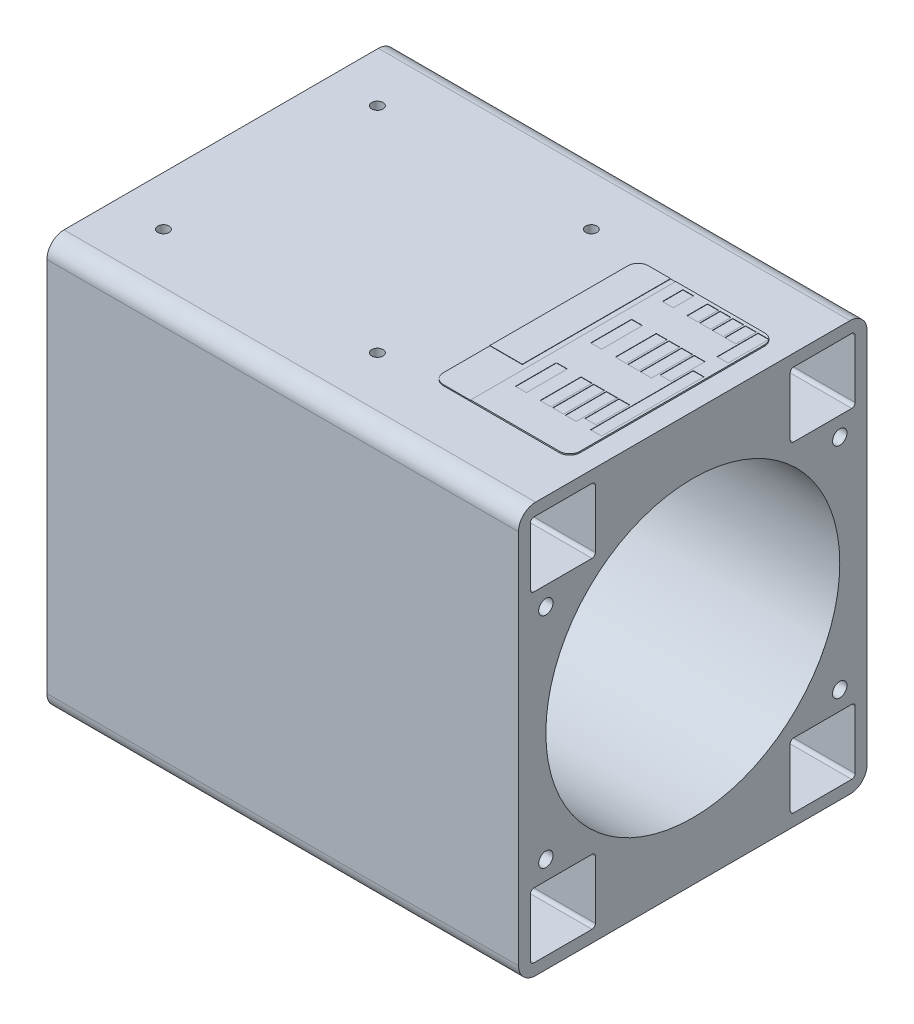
from build123d import *

# Parameters (mm, degrees)
SKETCH2_R                            = 43
BOSS_EXTRUDE1_DEPTH                  = 69
TAP_DRILL_FOR_M5X0_8_TAP1_AT_2_COUNT = 2
TAP_DRILL_FOR_M5X0_8_TAP1_AT_2_PITCH = 86
TAP_DRILL_FOR_M5X0_8_TAP1_AT_3_COUNT = 2
TAP_DRILL_FOR_M5X0_8_TAP1_AT_3_PITCH = 107.200746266
TAP_DRILL_FOR_M5X0_8_TAP1_AT_4_COUNT = 2
TAP_DRILL_FOR_M5X0_8_TAP1_AT_4_PITCH = 64
TAP_DRILL_FOR_M8X1_0_TAP1_D          = 7
TAP_DRILL_FOR_M8X1_0_TAP1_DEPTH      = 12
TAP_DRILL_FOR_M8X1_0_TAP1_TIP        = 2.103012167
TAP_DRILL_FOR_M4X0_7_TAP2_D          = 3.3
TAP_DRILL_FOR_M4X0_7_TAP2_DEPTH      = 3.5
BOSS_EXTRUDE2_DEPTH                  = 0.4
SKETCH10_W                           = 3.2
SKETCH10_H                           = 12
SKETCH10_H_2                         = 6
SKETCH10_H_3                         = 10
SKETCH10_H_4                         = 30
CUT_EXTRUDE1_DEPTH                   = 0.1


with BuildPart() as part:
    # Sketch2 → Boss-Extrude1 (new, symmetric)
    with BuildSketch(Plane(origin=(0, 0, 0), x_dir=(0, 0, -1), z_dir=(1, 0, 0))):
        with BuildLine():
            Line((-46, 60), (46, 60))
            ThreePointArc((46, 60), (49.535533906, 58.535533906), (51, 55))
            Line((51, 55), (51, -55))
            ThreePointArc((51, -55), (49.535533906, -58.535533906), (46, -60))
            Line((46, -60), (-46, -60))
            ThreePointArc((-46, -60), (-49.535533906, -58.535533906), (-51, -55))
            Line((-51, -55), (-51, 55))
            ThreePointArc((-51, 55), (-49.535533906, 58.535533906), (-46, 60))
        make_face()
        Circle(SKETCH2_R, mode=Mode.SUBTRACT)
        with BuildLine():
            Line((-46.5, 56.5), (-29.5, 56.5))
            ThreePointArc((-29.5, 56.5), (-28.792893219, 56.207106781), (-28.5, 55.5))
            Line((-28.5, 55.5), (-28.5, 38.5))
            ThreePointArc((-28.5, 38.5), (-28.792893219, 37.792893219), (-29.5, 37.5))
            Line((-29.5, 37.5), (-46.5, 37.5))
            ThreePointArc((-46.5, 37.5), (-47.207106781, 37.792893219), (-47.5, 38.5))
            Line((-47.5, 38.5), (-47.5, 55.5))
            ThreePointArc((-47.5, 55.5), (-47.207106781, 56.207106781), (-46.5, 56.5))
        make_face(mode=Mode.SUBTRACT)
        with BuildLine():
            Line((46.5, 56.5), (29.5, 56.5))
            ThreePointArc((29.5, 56.5), (28.792893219, 56.207106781), (28.5, 55.5))
            Line((28.5, 55.5), (28.5, 38.5))
            ThreePointArc((28.5, 38.5), (28.792893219, 37.792893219), (29.5, 37.5))
            Line((29.5, 37.5), (46.5, 37.5))
            ThreePointArc((46.5, 37.5), (47.207106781, 37.792893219), (47.5, 38.5))
            Line((47.5, 38.5), (47.5, 55.5))
            ThreePointArc((47.5, 55.5), (47.207106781, 56.207106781), (46.5, 56.5))
        make_face(mode=Mode.SUBTRACT)
        with BuildLine():
            Line((-46.5, -56.5), (-29.5, -56.5))
            ThreePointArc((-29.5, -56.5), (-28.792893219, -56.207106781), (-28.5, -55.5))
            Line((-28.5, -55.5), (-28.5, -38.5))
            ThreePointArc((-28.5, -38.5), (-28.792893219, -37.792893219), (-29.5, -37.5))
            Line((-29.5, -37.5), (-46.5, -37.5))
            ThreePointArc((-46.5, -37.5), (-47.207106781, -37.792893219), (-47.5, -38.5))
            Line((-47.5, -38.5), (-47.5, -55.5))
            ThreePointArc((-47.5, -55.5), (-47.207106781, -56.207106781), (-46.5, -56.5))
        make_face(mode=Mode.SUBTRACT)
        with BuildLine():
            Line((46.5, -56.5), (29.5, -56.5))
            ThreePointArc((29.5, -56.5), (28.792893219, -56.207106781), (28.5, -55.5))
            Line((28.5, -55.5), (28.5, -38.5))
            ThreePointArc((28.5, -38.5), (28.792893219, -37.792893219), (29.5, -37.5))
            Line((29.5, -37.5), (46.5, -37.5))
            ThreePointArc((46.5, -37.5), (47.207106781, -37.792893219), (47.5, -38.5))
            Line((47.5, -38.5), (47.5, -55.5))
            ThreePointArc((47.5, -55.5), (47.207106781, -56.207106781), (46.5, -56.5))
        make_face(mode=Mode.SUBTRACT)
    extrude(amount=BOSS_EXTRUDE1_DEPTH, both=True)

    # Sketch3 → Tap Drill for M5x0.8 Tap1 (revolve, cut)
    with BuildSketch(Plane(origin=(69, 32, 43), x_dir=(0, 0, -1), z_dir=(0, 1, 0))):
        Polygon((0, 0), (0, 16.2618073), (2.1, 15), (2.1, 0), align=None)
    tap_drill_for_m5x0_8_tap1 = revolve(axis=Axis((75.35, 32, 43), (-1, 0, 0)), mode=Mode.SUBTRACT)

    # Tap Drill for M5x0.8 Tap1 at 2: Tap Drill for M5x0.8 Tap1 ×2
    with Locations(*[(0, 0, -i * TAP_DRILL_FOR_M5X0_8_TAP1_AT_2_PITCH) for i in range(1, TAP_DRILL_FOR_M5X0_8_TAP1_AT_2_COUNT)]):
        add(tap_drill_for_m5x0_8_tap1, mode=Mode.SUBTRACT)

    # Tap Drill for M5x0.8 Tap1 at 3: Tap Drill for M5x0.8 Tap1 ×2
    with Locations(*[Vector(0, -0.5970107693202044, -0.8022332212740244) * (i * TAP_DRILL_FOR_M5X0_8_TAP1_AT_3_PITCH) for i in range(1, TAP_DRILL_FOR_M5X0_8_TAP1_AT_3_COUNT)]):
        add(tap_drill_for_m5x0_8_tap1, mode=Mode.SUBTRACT)

    # Tap Drill for M5x0.8 Tap1 at 4: Tap Drill for M5x0.8 Tap1 ×2
    with Locations(*[(0, -i * TAP_DRILL_FOR_M5X0_8_TAP1_AT_4_PITCH, 0) for i in range(1, TAP_DRILL_FOR_M5X0_8_TAP1_AT_4_COUNT)]):
        add(tap_drill_for_m5x0_8_tap1, mode=Mode.SUBTRACT)

    # Mirror1: Tap Drill for M5x0.8 Tap1 across plane
    add(tap_drill_for_m5x0_8_tap1.mirror(Plane(origin=(0, 0, 0), x_dir=(0, 0, 1), z_dir=(1, 0, 0))), mode=Mode.SUBTRACT)

    # Mirror1 copy 1 sketch → Mirror1 copy 1 (revolve, cut)
    with BuildSketch(Plane(origin=(-69, 32, -43), x_dir=(0, 0, -1), z_dir=(0, 1, 0))):
        Polygon((0, 0), (0, -16.2618073), (2.1, -15), (2.1, 0), align=None)
    revolve(axis=Axis((-75.35, 32, -43), (-1, 0, 0)), mode=Mode.SUBTRACT)

    # Mirror1 copy 2 sketch → Mirror1 copy 2 (revolve, cut)
    with BuildSketch(Plane(origin=(-69, -32, -43), x_dir=(0, 0, -1), z_dir=(0, 1, 0))):
        Polygon((0, 0), (0, -16.2618073), (2.1, -15), (2.1, 0), align=None)
    revolve(axis=Axis((-75.35, -32, -43), (-1, 0, 0)), mode=Mode.SUBTRACT)

    # Mirror1 copy 3 sketch → Mirror1 copy 3 (revolve, cut)
    with BuildSketch(Plane(origin=(-69, -32, 43), x_dir=(0, 0, -1), z_dir=(0, 1, 0))):
        Polygon((0, 0), (0, -16.2618073), (2.1, -15), (2.1, 0), align=None)
    revolve(axis=Axis((-75.35, -32, 43), (-1, 0, 0)), mode=Mode.SUBTRACT)

    # Tap Drill for M8x1.0 Tap1
    with Locations(Plane(origin=(0, 0, -51), x_dir=(-1, 0, 0), z_dir=(0, 0, -1))):
        with Locations((-44, 27.5), (44, 27.5), (-44, -27.5), (44, -27.5)):
            Hole(TAP_DRILL_FOR_M8X1_0_TAP1_D / 2, depth=TAP_DRILL_FOR_M8X1_0_TAP1_DEPTH)
            with Locations((0, 0, -(TAP_DRILL_FOR_M8X1_0_TAP1_DEPTH + TAP_DRILL_FOR_M8X1_0_TAP1_TIP / 2))):  # 118° drill point
                Cone(0, TAP_DRILL_FOR_M8X1_0_TAP1_D / 2, TAP_DRILL_FOR_M8X1_0_TAP1_TIP, mode=Mode.SUBTRACT)

    # Tap Drill for M4x0.7 Tap2
    with Locations(Plane(origin=(0, 60, 0), x_dir=(1, 0, 0), z_dir=(0, 1, 0))):
        with Locations((-54.6, 31.3), (8, 31.3), (8, -31.3), (-54.6, -31.3)):
            Hole(TAP_DRILL_FOR_M4X0_7_TAP2_D / 2, depth=TAP_DRILL_FOR_M4X0_7_TAP2_DEPTH)


with BuildPart() as body_2:
    # Sketch9 → Boss-Extrude2 (new body)
    with BuildSketch(Plane(origin=(0, 60, 0), x_dir=(1, 0, 0), z_dir=(0, 1, 0))):
        with BuildLine():
            Line((26, -30), (60, -30))
            ThreePointArc((60, -30), (62.121320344, -29.121320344), (63, -27))
            Line((63, -27), (63, 27))
            ThreePointArc((63, 27), (62.121320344, 29.121320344), (60, 30))
            Line((60, 30), (26, 30))
            ThreePointArc((26, 30), (23.878679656, 29.121320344), (23, 27))
            Line((23, 27), (23, -27))
            ThreePointArc((23, -27), (23.878679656, -29.121320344), (26, -30))
        make_face()
    extrude(amount=BOSS_EXTRUDE2_DEPTH)

    # Sketch10 → Cut-Extrude1 (cut)
    with BuildSketch(Plane(origin=(0, 60.4, 0), x_dir=(1, 0, 0), z_dir=(0, 1, 0))):
        Polygon((23, -30), (34, -30), (34, -13.387520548), (34, 30), (32.5, 30), (32.5, -13.387520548), (23, -13.387520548), align=None)
        with Locations((38.7, -14)):
            Rectangle(SKETCH10_W, SKETCH10_H)
        with Locations((38.7, 8)):
            Rectangle(SKETCH10_W, SKETCH10_H)
        with Locations((38.7, 26)):
            Rectangle(SKETCH10_W, SKETCH10_H_2)
        with Locations((45.9, -14)):
            Rectangle(SKETCH10_W, SKETCH10_H)
        with Locations((45.9, 8)):
            Rectangle(SKETCH10_W, SKETCH10_H)
        with Locations((45.9, 26)):
            Rectangle(SKETCH10_W, SKETCH10_H_2)
        with Locations((49.6, -14)):
            Rectangle(SKETCH10_W, SKETCH10_H)
        with Locations((49.6, 8)):
            Rectangle(SKETCH10_W, SKETCH10_H)
        with Locations((49.6, 26)):
            Rectangle(SKETCH10_W, SKETCH10_H_2)
        with Locations((53.3, -14)):
            Rectangle(SKETCH10_W, SKETCH10_H)
        with Locations((53.3, 8)):
            Rectangle(SKETCH10_W, SKETCH10_H)
        with Locations((53.3, 26)):
            Rectangle(SKETCH10_W, SKETCH10_H_2)
        with Locations((57, -13)):
            Rectangle(SKETCH10_W, SKETCH10_H_3)
        with Locations((57, 9)):
            Rectangle(SKETCH10_W, SKETCH10_H_3)
        with Locations((57, 26)):
            Rectangle(SKETCH10_W, SKETCH10_H_2)
        with Locations((60.7, -5)):
            Rectangle(SKETCH10_W, SKETCH10_H_4)
        with Locations((60.7, 23)):
            Rectangle(SKETCH10_W, SKETCH10_H)
    extrude(amount=-CUT_EXTRUDE1_DEPTH, mode=Mode.SUBTRACT)


solid = Compound([part.part, body_2.part])
